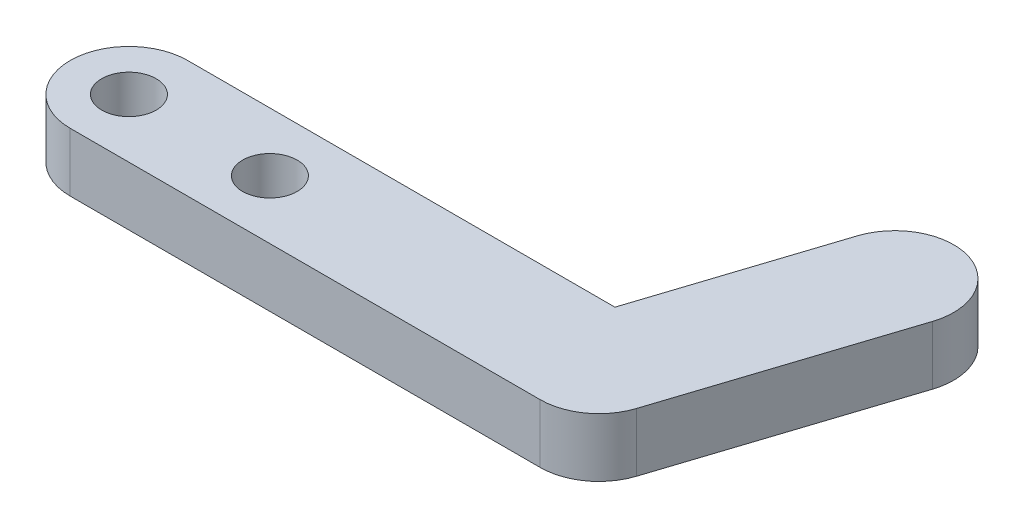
ISO-10303-21;
HEADER;
FILE_DESCRIPTION(('STEP AP214'),'2;1');
FILE_NAME('part.step','',(''),(''),'','','');
FILE_SCHEMA(('AUTOMOTIVE_DESIGN { 1 0 10303 214 1 1 1 1 }'));
ENDSEC;
DATA;
#1=APPLICATION_CONTEXT('core data for automotive mechanical design processes');
#2=APPLICATION_PROTOCOL_DEFINITION('international standard','automotive_design',2000,#1);
#3=PRODUCT_CONTEXT('',#1,'mechanical');
#4=PRODUCT('Part','Part','',(#3));
#5=PRODUCT_RELATED_PRODUCT_CATEGORY('part','',(#4));
#6=PRODUCT_DEFINITION_FORMATION('','',#4);
#7=PRODUCT_DEFINITION_CONTEXT('part definition',#1,'design');
#8=PRODUCT_DEFINITION('design','',#6,#7);
#9=PRODUCT_DEFINITION_SHAPE('','',#8);
#10=(LENGTH_UNIT() NAMED_UNIT(*) SI_UNIT(.MILLI.,.METRE.));
#11=(NAMED_UNIT(*) PLANE_ANGLE_UNIT() SI_UNIT($,.RADIAN.));
#12=(NAMED_UNIT(*) SI_UNIT($,.STERADIAN.) SOLID_ANGLE_UNIT());
#13=UNCERTAINTY_MEASURE_WITH_UNIT(LENGTH_MEASURE(1.E-05),#10,'distance_accuracy_value','');
#14=(GEOMETRIC_REPRESENTATION_CONTEXT(3) GLOBAL_UNCERTAINTY_ASSIGNED_CONTEXT((#13)) GLOBAL_UNIT_ASSIGNED_CONTEXT((#10,
#11,#12)) REPRESENTATION_CONTEXT('',''));
#15=CARTESIAN_POINT('',(0.,0.,0.));
#16=DIRECTION('',(0.,0.,1.));
#17=DIRECTION('',(1.,0.,0.));
#18=AXIS2_PLACEMENT_3D('',#15,#16,#17);
#19=CARTESIAN_POINT('',(25.4,3.175,0.));
#20=DIRECTION('',(0.,-1.,0.));
#21=DIRECTION('',(0.,0.,-1.));
#22=AXIS2_PLACEMENT_3D('',#19,#20,#21);
#23=CYLINDRICAL_SURFACE('',#22,3.175);
#24=DIRECTION('',(0.,-1.,0.));
#25=VECTOR('',#24,1.);
#26=CARTESIAN_POINT('',(28.4196044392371,3.175,0.981128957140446));
#27=LINE('',#26,#25);
#28=CARTESIAN_POINT('',(28.4196044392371,3.175,0.981128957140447));
#29=VERTEX_POINT('',#28);
#30=CARTESIAN_POINT('',(28.4196044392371,0.,0.981128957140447));
#31=VERTEX_POINT('',#30);
#32=EDGE_CURVE('E57',#29,#31,#27,.T.);
#33=ORIENTED_EDGE('',*,*,#32,.F.);
#34=CARTESIAN_POINT('',(25.4,3.175,0.));
#35=DIRECTION('',(0.,1.,0.));
#36=DIRECTION('',(0.,0.,1.));
#37=AXIS2_PLACEMENT_3D('',#34,#35,#36);
#38=CIRCLE('',#37,3.175);
#39=CARTESIAN_POINT('',(25.4,3.175,3.175));
#40=VERTEX_POINT('',#39);
#41=EDGE_CURVE('E101',#40,#29,#38,.T.);
#42=ORIENTED_EDGE('',*,*,#41,.F.);
#43=DIRECTION('',(0.,-1.,0.));
#44=VECTOR('',#43,1.);
#45=CARTESIAN_POINT('',(25.4,3.175,3.175));
#46=LINE('',#45,#44);
#47=CARTESIAN_POINT('',(25.4,0.,3.175));
#48=VERTEX_POINT('',#47);
#49=EDGE_CURVE('E42',#40,#48,#46,.T.);
#50=ORIENTED_EDGE('',*,*,#49,.T.);
#51=CARTESIAN_POINT('',(25.4,0.,0.));
#52=DIRECTION('',(0.,1.,0.));
#53=DIRECTION('',(0.,0.,1.));
#54=AXIS2_PLACEMENT_3D('',#51,#52,#53);
#55=CIRCLE('',#54,3.175);
#56=EDGE_CURVE('E146',#48,#31,#55,.T.);
#57=ORIENTED_EDGE('',*,*,#56,.T.);
#58=EDGE_LOOP('',(#33,#42,#50,#57));
#59=FACE_BOUND('',#58,.T.);
#60=ADVANCED_FACE('F34',(#59),#23,.T.);
#61=CARTESIAN_POINT('',(0.,3.175,-3.175));
#62=DIRECTION('',(0.,0.,1.));
#63=DIRECTION('',(1.,0.,0.));
#64=AXIS2_PLACEMENT_3D('',#61,#62,#63);
#65=PLANE('',#64);
#66=DIRECTION('',(0.,1.,0.));
#67=VECTOR('',#66,1.);
#68=CARTESIAN_POINT('',(23.093227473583,3.175,-3.175));
#69=LINE('',#68,#67);
#70=CARTESIAN_POINT('',(23.093227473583,0.,-3.175));
#71=VERTEX_POINT('',#70);
#72=CARTESIAN_POINT('',(23.093227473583,3.175,-3.175));
#73=VERTEX_POINT('',#72);
#74=EDGE_CURVE('E130',#71,#73,#69,.T.);
#75=ORIENTED_EDGE('',*,*,#74,.F.);
#76=DIRECTION('',(-1.,0.,0.));
#77=VECTOR('',#76,1.);
#78=CARTESIAN_POINT('',(0.,0.,-3.175));
#79=LINE('',#78,#77);
#80=CARTESIAN_POINT('',(0.,0.,-3.175));
#81=VERTEX_POINT('',#80);
#82=EDGE_CURVE('E137',#71,#81,#79,.T.);
#83=ORIENTED_EDGE('',*,*,#82,.T.);
#84=DIRECTION('',(0.,-1.,0.));
#85=VECTOR('',#84,1.);
#86=CARTESIAN_POINT('',(0.,3.175,-3.175));
#87=LINE('',#86,#85);
#88=CARTESIAN_POINT('',(0.,3.175,-3.175));
#89=VERTEX_POINT('',#88);
#90=EDGE_CURVE('E141',#89,#81,#87,.T.);
#91=ORIENTED_EDGE('',*,*,#90,.F.);
#92=DIRECTION('',(-1.,0.,0.));
#93=VECTOR('',#92,1.);
#94=CARTESIAN_POINT('',(0.,3.175,-3.175));
#95=LINE('',#94,#93);
#96=EDGE_CURVE('E49',#73,#89,#95,.T.);
#97=ORIENTED_EDGE('',*,*,#96,.F.);
#98=EDGE_LOOP('',(#75,#83,#91,#97));
#99=FACE_BOUND('',#98,.T.);
#100=ADVANCED_FACE('F162',(#99),#65,.F.);
#101=CARTESIAN_POINT('',(0.,3.175,0.));
#102=DIRECTION('',(0.,-1.,0.));
#103=DIRECTION('',(0.,0.,-1.));
#104=AXIS2_PLACEMENT_3D('',#101,#102,#103);
#105=CYLINDRICAL_SURFACE('',#104,3.175);
#106=CARTESIAN_POINT('',(0.,0.,0.));
#107=DIRECTION('',(0.,1.,0.));
#108=DIRECTION('',(0.,0.,1.));
#109=AXIS2_PLACEMENT_3D('',#106,#107,#108);
#110=CIRCLE('',#109,3.175);
#111=CARTESIAN_POINT('',(0.,0.,3.175));
#112=VERTEX_POINT('',#111);
#113=EDGE_CURVE('E132',#81,#112,#110,.T.);
#114=ORIENTED_EDGE('',*,*,#113,.T.);
#115=DIRECTION('',(0.,-1.,0.));
#116=VECTOR('',#115,1.);
#117=CARTESIAN_POINT('',(0.,3.175,3.175));
#118=LINE('',#117,#116);
#119=CARTESIAN_POINT('',(0.,3.175,3.175));
#120=VERTEX_POINT('',#119);
#121=EDGE_CURVE('E11',#120,#112,#118,.T.);
#122=ORIENTED_EDGE('',*,*,#121,.F.);
#123=CARTESIAN_POINT('',(0.,3.175,0.));
#124=DIRECTION('',(0.,1.,0.));
#125=DIRECTION('',(0.,0.,1.));
#126=AXIS2_PLACEMENT_3D('',#123,#124,#125);
#127=CIRCLE('',#126,3.175);
#128=EDGE_CURVE('E133',#89,#120,#127,.T.);
#129=ORIENTED_EDGE('',*,*,#128,.F.);
#130=ORIENTED_EDGE('',*,*,#90,.T.);
#131=EDGE_LOOP('',(#114,#122,#129,#130));
#132=FACE_BOUND('',#131,.T.);
#133=ADVANCED_FACE('F36',(#132),#105,.T.);
#134=CARTESIAN_POINT('',(0.,3.175,3.175));
#135=DIRECTION('',(0.,0.,-1.));
#136=DIRECTION('',(-1.,0.,0.));
#137=AXIS2_PLACEMENT_3D('',#134,#135,#136);
#138=PLANE('',#137);
#139=DIRECTION('',(1.,0.,0.));
#140=VECTOR('',#139,1.);
#141=CARTESIAN_POINT('',(0.,0.,3.175));
#142=LINE('',#141,#140);
#143=EDGE_CURVE('E144',#112,#48,#142,.T.);
#144=ORIENTED_EDGE('',*,*,#143,.T.);
#145=ORIENTED_EDGE('',*,*,#49,.F.);
#146=DIRECTION('',(1.,0.,0.));
#147=VECTOR('',#146,1.);
#148=CARTESIAN_POINT('',(0.,3.175,3.175));
#149=LINE('',#148,#147);
#150=EDGE_CURVE('E136',#120,#40,#149,.T.);
#151=ORIENTED_EDGE('',*,*,#150,.F.);
#152=ORIENTED_EDGE('',*,*,#121,.T.);
#153=EDGE_LOOP('',(#144,#145,#151,#152));
#154=FACE_BOUND('',#153,.T.);
#155=ADVANCED_FACE('F164',(#154),#138,.F.);
#156=CARTESIAN_POINT('',(0.,3.175,0.));
#157=DIRECTION('',(0.,1.,0.));
#158=DIRECTION('',(0.,0.,1.));
#159=AXIS2_PLACEMENT_3D('',#156,#157,#158);
#160=PLANE('',#159);
#161=CARTESIAN_POINT('',(0.,3.175,0.));
#162=DIRECTION('',(0.,1.,0.));
#163=DIRECTION('',(0.,0.,1.));
#164=AXIS2_PLACEMENT_3D('',#161,#162,#163);
#165=CIRCLE('',#164,1.47319999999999);
#166=CARTESIAN_POINT('',(0.,3.175,1.47319999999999));
#167=VERTEX_POINT('',#166);
#168=EDGE_CURVE('E203',#167,#167,#165,.T.);
#169=ORIENTED_EDGE('',*,*,#168,.F.);
#170=EDGE_LOOP('',(#169));
#171=FACE_BOUND('',#170,.T.);
#172=CARTESIAN_POINT('',(7.62,3.175,0.));
#173=DIRECTION('',(0.,1.,0.));
#174=DIRECTION('',(0.,0.,1.));
#175=AXIS2_PLACEMENT_3D('',#172,#173,#174);
#176=CIRCLE('',#175,1.47319999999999);
#177=CARTESIAN_POINT('',(7.62,3.175,1.47319999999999));
#178=VERTEX_POINT('',#177);
#179=EDGE_CURVE('E205',#178,#178,#176,.T.);
#180=ORIENTED_EDGE('',*,*,#179,.F.);
#181=EDGE_LOOP('',(#180));
#182=FACE_BOUND('',#181,.T.);
#183=ORIENTED_EDGE('',*,*,#150,.T.);
#184=ORIENTED_EDGE('',*,*,#41,.T.);
#185=DIRECTION('',(0.309016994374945,0.,-0.951056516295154));
#186=VECTOR('',#185,1.);
#187=CARTESIAN_POINT('',(28.4196044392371,3.175,0.981128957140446));
#188=LINE('',#187,#186);
#189=CARTESIAN_POINT('',(32.3441202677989,3.175,-11.097288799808));
#190=VERTEX_POINT('',#189);
#191=EDGE_CURVE('E94',#29,#190,#188,.T.);
#192=ORIENTED_EDGE('',*,*,#191,.T.);
#193=CARTESIAN_POINT('',(29.3245158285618,3.175,-12.0784177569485));
#194=DIRECTION('',(0.,1.,0.));
#195=DIRECTION('',(0.,0.,1.));
#196=AXIS2_PLACEMENT_3D('',#193,#194,#195);
#197=CIRCLE('',#196,3.175);
#198=CARTESIAN_POINT('',(26.3049113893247,3.175,-13.0595467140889));
#199=VERTEX_POINT('',#198);
#200=EDGE_CURVE('E99',#190,#199,#197,.T.);
#201=ORIENTED_EDGE('',*,*,#200,.T.);
#202=DIRECTION('',(-0.309016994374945,0.,0.951056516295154));
#203=VECTOR('',#202,1.);
#204=CARTESIAN_POINT('',(22.3803955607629,3.175,-0.981128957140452));
#205=LINE('',#204,#203);
#206=EDGE_CURVE('E117',#199,#73,#205,.T.);
#207=ORIENTED_EDGE('',*,*,#206,.T.);
#208=ORIENTED_EDGE('',*,*,#96,.T.);
#209=ORIENTED_EDGE('',*,*,#128,.T.);
#210=EDGE_LOOP('',(#183,#184,#192,#201,#207,#208,#209));
#211=FACE_BOUND('',#210,.T.);
#212=ADVANCED_FACE('F96',(#171,#182,#211),#160,.T.);
#213=CARTESIAN_POINT('',(0.,0.,0.));
#214=DIRECTION('',(0.,1.,0.));
#215=DIRECTION('',(0.,0.,1.));
#216=AXIS2_PLACEMENT_3D('',#213,#214,#215);
#217=PLANE('',#216);
#218=CARTESIAN_POINT('',(0.,0.,0.));
#219=DIRECTION('',(0.,1.,0.));
#220=DIRECTION('',(0.,0.,1.));
#221=AXIS2_PLACEMENT_3D('',#218,#219,#220);
#222=CIRCLE('',#221,1.4732);
#223=CARTESIAN_POINT('',(0.,0.,1.4732));
#224=VERTEX_POINT('',#223);
#225=EDGE_CURVE('E200',#224,#224,#222,.T.);
#226=ORIENTED_EDGE('',*,*,#225,.T.);
#227=EDGE_LOOP('',(#226));
#228=FACE_BOUND('',#227,.T.);
#229=CARTESIAN_POINT('',(7.62,0.,0.));
#230=DIRECTION('',(0.,1.,0.));
#231=DIRECTION('',(0.,0.,1.));
#232=AXIS2_PLACEMENT_3D('',#229,#230,#231);
#233=CIRCLE('',#232,1.4732);
#234=CARTESIAN_POINT('',(7.62,0.,1.4732));
#235=VERTEX_POINT('',#234);
#236=EDGE_CURVE('E124',#235,#235,#233,.T.);
#237=ORIENTED_EDGE('',*,*,#236,.T.);
#238=EDGE_LOOP('',(#237));
#239=FACE_BOUND('',#238,.T.);
#240=ORIENTED_EDGE('',*,*,#56,.F.);
#241=ORIENTED_EDGE('',*,*,#143,.F.);
#242=ORIENTED_EDGE('',*,*,#113,.F.);
#243=ORIENTED_EDGE('',*,*,#82,.F.);
#244=DIRECTION('',(-0.309016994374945,0.,0.951056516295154));
#245=VECTOR('',#244,1.);
#246=CARTESIAN_POINT('',(22.3803955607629,0.,-0.981128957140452));
#247=LINE('',#246,#245);
#248=CARTESIAN_POINT('',(26.3049113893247,0.,-13.0595467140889));
#249=VERTEX_POINT('',#248);
#250=EDGE_CURVE('E103',#249,#71,#247,.T.);
#251=ORIENTED_EDGE('',*,*,#250,.F.);
#252=CARTESIAN_POINT('',(29.3245158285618,0.,-12.0784177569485));
#253=DIRECTION('',(0.,1.,0.));
#254=DIRECTION('',(0.,0.,1.));
#255=AXIS2_PLACEMENT_3D('',#252,#253,#254);
#256=CIRCLE('',#255,3.175);
#257=CARTESIAN_POINT('',(32.3441202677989,0.,-11.097288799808));
#258=VERTEX_POINT('',#257);
#259=EDGE_CURVE('E123',#258,#249,#256,.T.);
#260=ORIENTED_EDGE('',*,*,#259,.F.);
#261=DIRECTION('',(0.309016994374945,0.,-0.951056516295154));
#262=VECTOR('',#261,1.);
#263=CARTESIAN_POINT('',(28.4196044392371,0.,0.981128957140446));
#264=LINE('',#263,#262);
#265=EDGE_CURVE('E109',#31,#258,#264,.T.);
#266=ORIENTED_EDGE('',*,*,#265,.F.);
#267=EDGE_LOOP('',(#240,#241,#242,#243,#251,#260,#266));
#268=FACE_BOUND('',#267,.T.);
#269=ADVANCED_FACE('F155',(#228,#239,#268),#217,.F.);
#270=CARTESIAN_POINT('',(22.3803955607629,3.175,-0.981128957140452));
#271=DIRECTION('',(0.951056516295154,0.,0.309016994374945));
#272=DIRECTION('',(0.309016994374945,0.,-0.951056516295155));
#273=AXIS2_PLACEMENT_3D('',#270,#271,#272);
#274=PLANE('',#273);
#275=ORIENTED_EDGE('',*,*,#250,.T.);
#276=ORIENTED_EDGE('',*,*,#74,.T.);
#277=ORIENTED_EDGE('',*,*,#206,.F.);
#278=DIRECTION('',(0.,-1.,0.));
#279=VECTOR('',#278,1.);
#280=CARTESIAN_POINT('',(26.3049113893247,3.175,-13.0595467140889));
#281=LINE('',#280,#279);
#282=EDGE_CURVE('E112',#199,#249,#281,.T.);
#283=ORIENTED_EDGE('',*,*,#282,.T.);
#284=EDGE_LOOP('',(#275,#276,#277,#283));
#285=FACE_BOUND('',#284,.T.);
#286=ADVANCED_FACE('F159',(#285),#274,.F.);
#287=CARTESIAN_POINT('',(28.4196044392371,3.175,0.981128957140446));
#288=DIRECTION('',(-0.951056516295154,0.,-0.309016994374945));
#289=DIRECTION('',(-0.309016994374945,0.,0.951056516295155));
#290=AXIS2_PLACEMENT_3D('',#287,#288,#289);
#291=PLANE('',#290);
#292=ORIENTED_EDGE('',*,*,#265,.T.);
#293=DIRECTION('',(0.,-1.,0.));
#294=VECTOR('',#293,1.);
#295=CARTESIAN_POINT('',(32.3441202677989,3.175,-11.097288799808));
#296=LINE('',#295,#294);
#297=EDGE_CURVE('E106',#190,#258,#296,.T.);
#298=ORIENTED_EDGE('',*,*,#297,.F.);
#299=ORIENTED_EDGE('',*,*,#191,.F.);
#300=ORIENTED_EDGE('',*,*,#32,.T.);
#301=EDGE_LOOP('',(#292,#298,#299,#300));
#302=FACE_BOUND('',#301,.T.);
#303=ADVANCED_FACE('F107',(#302),#291,.F.);
#304=CARTESIAN_POINT('',(29.3245158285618,3.175,-12.0784177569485));
#305=DIRECTION('',(0.,-1.,0.));
#306=DIRECTION('',(0.,0.,-1.));
#307=AXIS2_PLACEMENT_3D('',#304,#305,#306);
#308=CYLINDRICAL_SURFACE('',#307,3.175);
#309=ORIENTED_EDGE('',*,*,#259,.T.);
#310=ORIENTED_EDGE('',*,*,#282,.F.);
#311=ORIENTED_EDGE('',*,*,#200,.F.);
#312=ORIENTED_EDGE('',*,*,#297,.T.);
#313=EDGE_LOOP('',(#309,#310,#311,#312));
#314=FACE_BOUND('',#313,.T.);
#315=ADVANCED_FACE('F114',(#314),#308,.T.);
#316=CARTESIAN_POINT('',(7.62,3.175,0.));
#317=DIRECTION('',(0.,1.,0.));
#318=DIRECTION('',(0.,0.,1.));
#319=AXIS2_PLACEMENT_3D('',#316,#317,#318);
#320=CYLINDRICAL_SURFACE('',#319,1.47319999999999);
#321=ORIENTED_EDGE('',*,*,#236,.F.);
#322=EDGE_LOOP('',(#321));
#323=FACE_BOUND('',#322,.T.);
#324=ORIENTED_EDGE('',*,*,#179,.T.);
#325=EDGE_LOOP('',(#324));
#326=FACE_BOUND('',#325,.T.);
#327=ADVANCED_FACE('F186',(#323,#326),#320,.F.);
#328=CARTESIAN_POINT('',(0.,3.175,0.));
#329=DIRECTION('',(0.,1.,0.));
#330=DIRECTION('',(0.,0.,1.));
#331=AXIS2_PLACEMENT_3D('',#328,#329,#330);
#332=CYLINDRICAL_SURFACE('',#331,1.47319999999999);
#333=ORIENTED_EDGE('',*,*,#225,.F.);
#334=EDGE_LOOP('',(#333));
#335=FACE_BOUND('',#334,.T.);
#336=ORIENTED_EDGE('',*,*,#168,.T.);
#337=EDGE_LOOP('',(#336));
#338=FACE_BOUND('',#337,.T.);
#339=ADVANCED_FACE('F191',(#335,#338),#332,.F.);
#340=CLOSED_SHELL('',(#60,#100,#133,#155,#212,#269,#286,#303,#315,#327,#339));
#341=MANIFOLD_SOLID_BREP('B2',#340);
#342=ADVANCED_BREP_SHAPE_REPRESENTATION('',(#18,#341),#14);
#343=SHAPE_DEFINITION_REPRESENTATION(#9,#342);
ENDSEC;
END-ISO-10303-21;
